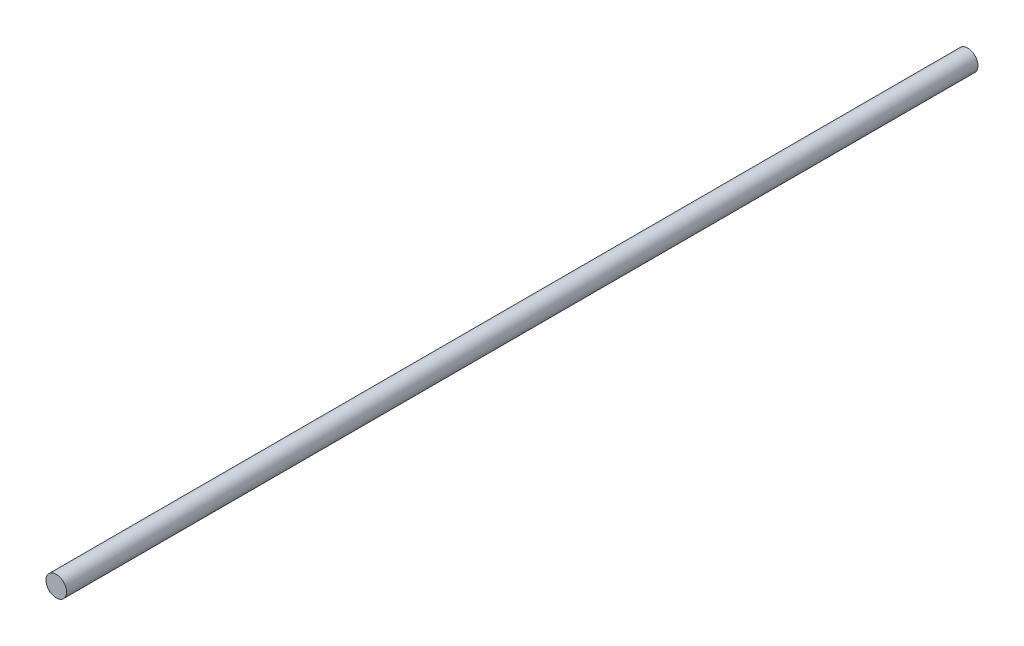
from build123d import *

# Parameters (mm, degrees)
ESQUISSE1_R      = 4
EXTRUSION1_DEPTH = 355


with BuildPart() as part:
    # Esquisse1 → Extrusion1 (new body)
    with BuildSketch(Plane.XY):
        Circle(ESQUISSE1_R)
    extrude(amount=EXTRUSION1_DEPTH)


solid = part.part
